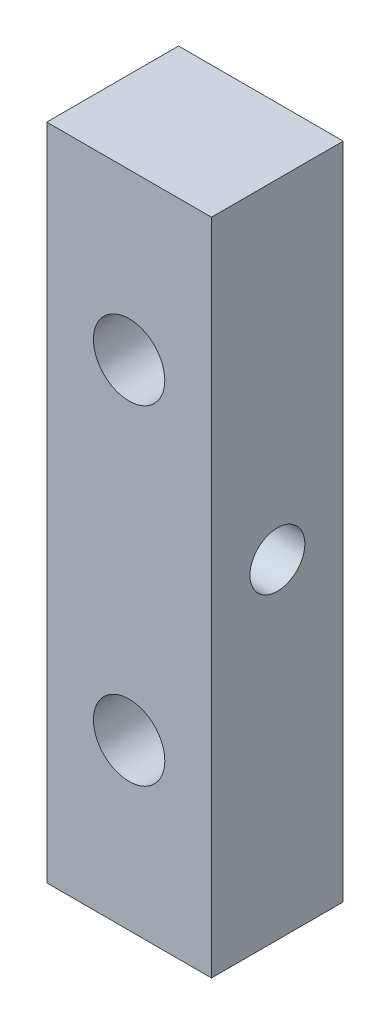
ISO-10303-21;
HEADER;
FILE_DESCRIPTION(('STEP AP214'),'2;1');
FILE_NAME('part.step','',(''),(''),'','','');
FILE_SCHEMA(('AUTOMOTIVE_DESIGN { 1 0 10303 214 1 1 1 1 }'));
ENDSEC;
DATA;
#1=APPLICATION_CONTEXT('core data for automotive mechanical design processes');
#2=APPLICATION_PROTOCOL_DEFINITION('international standard','automotive_design',2000,#1);
#3=PRODUCT_CONTEXT('',#1,'mechanical');
#4=PRODUCT('Part','Part','',(#3));
#5=PRODUCT_RELATED_PRODUCT_CATEGORY('part','',(#4));
#6=PRODUCT_DEFINITION_FORMATION('','',#4);
#7=PRODUCT_DEFINITION_CONTEXT('part definition',#1,'design');
#8=PRODUCT_DEFINITION('design','',#6,#7);
#9=PRODUCT_DEFINITION_SHAPE('','',#8);
#10=(LENGTH_UNIT() NAMED_UNIT(*) SI_UNIT(.MILLI.,.METRE.));
#11=(NAMED_UNIT(*) PLANE_ANGLE_UNIT() SI_UNIT($,.RADIAN.));
#12=(NAMED_UNIT(*) SI_UNIT($,.STERADIAN.) SOLID_ANGLE_UNIT());
#13=UNCERTAINTY_MEASURE_WITH_UNIT(LENGTH_MEASURE(1.E-05),#10,'distance_accuracy_value','');
#14=(GEOMETRIC_REPRESENTATION_CONTEXT(3) GLOBAL_UNCERTAINTY_ASSIGNED_CONTEXT((#13)) GLOBAL_UNIT_ASSIGNED_CONTEXT((#10,
#11,#12)) REPRESENTATION_CONTEXT('',''));
#15=CARTESIAN_POINT('',(0.,0.,0.));
#16=DIRECTION('',(0.,0.,1.));
#17=DIRECTION('',(1.,0.,0.));
#18=AXIS2_PLACEMENT_3D('',#15,#16,#17);
#19=CARTESIAN_POINT('',(-7.5,0.,6.));
#20=DIRECTION('',(-1.,0.,0.));
#21=DIRECTION('',(0.,0.,1.));
#22=AXIS2_PLACEMENT_3D('',#19,#20,#21);
#23=CYLINDRICAL_SURFACE('',#22,2.5);
#24=CARTESIAN_POINT('',(7.5,0.,6.));
#25=DIRECTION('',(-1.,0.,0.));
#26=DIRECTION('',(0.,0.,1.));
#27=AXIS2_PLACEMENT_3D('',#24,#25,#26);
#28=CIRCLE('',#27,2.5);
#29=CARTESIAN_POINT('',(7.5,0.,8.5));
#30=VERTEX_POINT('',#29);
#31=EDGE_CURVE('E70',#30,#30,#28,.F.);
#32=ORIENTED_EDGE('',*,*,#31,.T.);
#33=EDGE_LOOP('',(#32));
#34=FACE_BOUND('',#33,.T.);
#35=CARTESIAN_POINT('',(-7.5,0.,6.));
#36=DIRECTION('',(-1.,0.,0.));
#37=DIRECTION('',(0.,0.,1.));
#38=AXIS2_PLACEMENT_3D('',#35,#36,#37);
#39=CIRCLE('',#38,2.5);
#40=CARTESIAN_POINT('',(-7.5,0.,8.5));
#41=VERTEX_POINT('',#40);
#42=EDGE_CURVE('E76',#41,#41,#39,.T.);
#43=ORIENTED_EDGE('',*,*,#42,.T.);
#44=EDGE_LOOP('',(#43));
#45=FACE_BOUND('',#44,.T.);
#46=ADVANCED_FACE('F17',(#34,#45),#23,.F.);
#47=CARTESIAN_POINT('',(0.,0.,0.));
#48=DIRECTION('',(0.,0.,1.));
#49=DIRECTION('',(1.,0.,0.));
#50=AXIS2_PLACEMENT_3D('',#47,#48,#49);
#51=PLANE('',#50);
#52=DIRECTION('',(1.,0.,0.));
#53=VECTOR('',#52,1.);
#54=CARTESIAN_POINT('',(-7.5,-30.,0.));
#55=LINE('',#54,#53);
#56=CARTESIAN_POINT('',(7.5,-30.,0.));
#57=VERTEX_POINT('',#56);
#58=CARTESIAN_POINT('',(-7.5,-30.,0.));
#59=VERTEX_POINT('',#58);
#60=EDGE_CURVE('E92',#57,#59,#55,.F.);
#61=ORIENTED_EDGE('',*,*,#60,.T.);
#62=DIRECTION('',(0.,1.,0.));
#63=VECTOR('',#62,1.);
#64=CARTESIAN_POINT('',(-7.5,30.,0.));
#65=LINE('',#64,#63);
#66=CARTESIAN_POINT('',(-7.5,30.,0.));
#67=VERTEX_POINT('',#66);
#68=EDGE_CURVE('E74',#59,#67,#65,.T.);
#69=ORIENTED_EDGE('',*,*,#68,.T.);
#70=DIRECTION('',(1.,0.,0.));
#71=VECTOR('',#70,1.);
#72=CARTESIAN_POINT('',(-7.5,30.,0.));
#73=LINE('',#72,#71);
#74=CARTESIAN_POINT('',(7.5,30.,0.));
#75=VERTEX_POINT('',#74);
#76=EDGE_CURVE('E55',#67,#75,#73,.T.);
#77=ORIENTED_EDGE('',*,*,#76,.T.);
#78=DIRECTION('',(0.,-1.,0.));
#79=VECTOR('',#78,1.);
#80=CARTESIAN_POINT('',(7.5,30.,0.));
#81=LINE('',#80,#79);
#82=EDGE_CURVE('E60',#75,#57,#81,.T.);
#83=ORIENTED_EDGE('',*,*,#82,.T.);
#84=EDGE_LOOP('',(#61,#69,#77,#83));
#85=FACE_BOUND('',#84,.T.);
#86=CARTESIAN_POINT('',(0.,15.,0.));
#87=DIRECTION('',(0.,0.,1.));
#88=DIRECTION('',(1.,0.,0.));
#89=AXIS2_PLACEMENT_3D('',#86,#87,#88);
#90=CIRCLE('',#89,3.25);
#91=CARTESIAN_POINT('',(3.25,15.,0.));
#92=VERTEX_POINT('',#91);
#93=EDGE_CURVE('E97',#92,#92,#90,.T.);
#94=ORIENTED_EDGE('',*,*,#93,.T.);
#95=EDGE_LOOP('',(#94));
#96=FACE_BOUND('',#95,.T.);
#97=CARTESIAN_POINT('',(0.,-15.,0.));
#98=DIRECTION('',(0.,0.,1.));
#99=DIRECTION('',(1.,0.,0.));
#100=AXIS2_PLACEMENT_3D('',#97,#98,#99);
#101=CIRCLE('',#100,3.25);
#102=CARTESIAN_POINT('',(3.25,-15.,0.));
#103=VERTEX_POINT('',#102);
#104=EDGE_CURVE('E20',#103,#103,#101,.T.);
#105=ORIENTED_EDGE('',*,*,#104,.T.);
#106=EDGE_LOOP('',(#105));
#107=FACE_BOUND('',#106,.T.);
#108=ADVANCED_FACE('F72',(#85,#96,#107),#51,.F.);
#109=CARTESIAN_POINT('',(0.,-15.,0.));
#110=DIRECTION('',(0.,0.,1.));
#111=DIRECTION('',(1.,0.,0.));
#112=AXIS2_PLACEMENT_3D('',#109,#110,#111);
#113=CYLINDRICAL_SURFACE('',#112,3.25);
#114=CARTESIAN_POINT('',(0.,-15.,12.));
#115=DIRECTION('',(0.,0.,1.));
#116=DIRECTION('',(1.,0.,0.));
#117=AXIS2_PLACEMENT_3D('',#114,#115,#116);
#118=CIRCLE('',#117,3.25);
#119=CARTESIAN_POINT('',(3.25,-15.,12.));
#120=VERTEX_POINT('',#119);
#121=EDGE_CURVE('E89',#120,#120,#118,.F.);
#122=ORIENTED_EDGE('',*,*,#121,.F.);
#123=EDGE_LOOP('',(#122));
#124=FACE_BOUND('',#123,.T.);
#125=ORIENTED_EDGE('',*,*,#104,.F.);
#126=EDGE_LOOP('',(#125));
#127=FACE_BOUND('',#126,.T.);
#128=ADVANCED_FACE('F104',(#124,#127),#113,.F.);
#129=CARTESIAN_POINT('',(0.,15.,0.));
#130=DIRECTION('',(0.,0.,1.));
#131=DIRECTION('',(1.,0.,0.));
#132=AXIS2_PLACEMENT_3D('',#129,#130,#131);
#133=CYLINDRICAL_SURFACE('',#132,3.25);
#134=CARTESIAN_POINT('',(0.,15.,12.));
#135=DIRECTION('',(0.,0.,1.));
#136=DIRECTION('',(1.,0.,0.));
#137=AXIS2_PLACEMENT_3D('',#134,#135,#136);
#138=CIRCLE('',#137,3.25);
#139=CARTESIAN_POINT('',(3.25,15.,12.));
#140=VERTEX_POINT('',#139);
#141=EDGE_CURVE('E85',#140,#140,#138,.F.);
#142=ORIENTED_EDGE('',*,*,#141,.F.);
#143=EDGE_LOOP('',(#142));
#144=FACE_BOUND('',#143,.T.);
#145=ORIENTED_EDGE('',*,*,#93,.F.);
#146=EDGE_LOOP('',(#145));
#147=FACE_BOUND('',#146,.T.);
#148=ADVANCED_FACE('F106',(#144,#147),#133,.F.);
#149=CARTESIAN_POINT('',(7.5,30.,12.));
#150=DIRECTION('',(-1.,0.,0.));
#151=DIRECTION('',(0.,-1.,0.));
#152=AXIS2_PLACEMENT_3D('',#149,#150,#151);
#153=PLANE('',#152);
#154=DIRECTION('',(0.,0.,-1.));
#155=VECTOR('',#154,1.);
#156=CARTESIAN_POINT('',(7.5,30.,12.));
#157=LINE('',#156,#155);
#158=CARTESIAN_POINT('',(7.5,30.,12.));
#159=VERTEX_POINT('',#158);
#160=EDGE_CURVE('E63',#75,#159,#157,.F.);
#161=ORIENTED_EDGE('',*,*,#160,.T.);
#162=DIRECTION('',(0.,1.,0.));
#163=VECTOR('',#162,1.);
#164=CARTESIAN_POINT('',(7.5,0.,12.));
#165=LINE('',#164,#163);
#166=CARTESIAN_POINT('',(7.5,-30.,12.));
#167=VERTEX_POINT('',#166);
#168=EDGE_CURVE('E88',#167,#159,#165,.T.);
#169=ORIENTED_EDGE('',*,*,#168,.F.);
#170=DIRECTION('',(0.,0.,1.));
#171=VECTOR('',#170,1.);
#172=CARTESIAN_POINT('',(7.5,-30.,12.));
#173=LINE('',#172,#171);
#174=EDGE_CURVE('E66',#167,#57,#173,.F.);
#175=ORIENTED_EDGE('',*,*,#174,.T.);
#176=ORIENTED_EDGE('',*,*,#82,.F.);
#177=EDGE_LOOP('',(#161,#169,#175,#176));
#178=FACE_BOUND('',#177,.T.);
#179=ORIENTED_EDGE('',*,*,#31,.F.);
#180=EDGE_LOOP('',(#179));
#181=FACE_BOUND('',#180,.T.);
#182=ADVANCED_FACE('F61',(#178,#181),#153,.F.);
#183=CARTESIAN_POINT('',(-7.5,30.,12.));
#184=DIRECTION('',(0.,-1.,0.));
#185=DIRECTION('',(0.,0.,-1.));
#186=AXIS2_PLACEMENT_3D('',#183,#184,#185);
#187=PLANE('',#186);
#188=DIRECTION('',(0.,0.,1.));
#189=VECTOR('',#188,1.);
#190=CARTESIAN_POINT('',(-7.5,30.,12.));
#191=LINE('',#190,#189);
#192=CARTESIAN_POINT('',(-7.5,30.,12.));
#193=VERTEX_POINT('',#192);
#194=EDGE_CURVE('E95',#67,#193,#191,.T.);
#195=ORIENTED_EDGE('',*,*,#194,.T.);
#196=DIRECTION('',(1.,0.,0.));
#197=VECTOR('',#196,1.);
#198=CARTESIAN_POINT('',(0.,30.,12.));
#199=LINE('',#198,#197);
#200=EDGE_CURVE('E80',#159,#193,#199,.F.);
#201=ORIENTED_EDGE('',*,*,#200,.F.);
#202=ORIENTED_EDGE('',*,*,#160,.F.);
#203=ORIENTED_EDGE('',*,*,#76,.F.);
#204=EDGE_LOOP('',(#195,#201,#202,#203));
#205=FACE_BOUND('',#204,.T.);
#206=ADVANCED_FACE('F78',(#205),#187,.F.);
#207=CARTESIAN_POINT('',(-7.5,30.,12.));
#208=DIRECTION('',(1.,0.,0.));
#209=DIRECTION('',(0.,1.,0.));
#210=AXIS2_PLACEMENT_3D('',#207,#208,#209);
#211=PLANE('',#210);
#212=DIRECTION('',(0.,0.,1.));
#213=VECTOR('',#212,1.);
#214=CARTESIAN_POINT('',(-7.5,-30.,12.));
#215=LINE('',#214,#213);
#216=CARTESIAN_POINT('',(-7.5,-30.,12.));
#217=VERTEX_POINT('',#216);
#218=EDGE_CURVE('E35',#59,#217,#215,.T.);
#219=ORIENTED_EDGE('',*,*,#218,.T.);
#220=DIRECTION('',(0.,1.,0.));
#221=VECTOR('',#220,1.);
#222=CARTESIAN_POINT('',(-7.5,0.,12.));
#223=LINE('',#222,#221);
#224=EDGE_CURVE('E26',#193,#217,#223,.F.);
#225=ORIENTED_EDGE('',*,*,#224,.F.);
#226=ORIENTED_EDGE('',*,*,#194,.F.);
#227=ORIENTED_EDGE('',*,*,#68,.F.);
#228=EDGE_LOOP('',(#219,#225,#226,#227));
#229=FACE_BOUND('',#228,.T.);
#230=ORIENTED_EDGE('',*,*,#42,.F.);
#231=EDGE_LOOP('',(#230));
#232=FACE_BOUND('',#231,.T.);
#233=ADVANCED_FACE('F125',(#229,#232),#211,.F.);
#234=CARTESIAN_POINT('',(-7.5,-30.,12.));
#235=DIRECTION('',(0.,1.,0.));
#236=DIRECTION('',(0.,0.,1.));
#237=AXIS2_PLACEMENT_3D('',#234,#235,#236);
#238=PLANE('',#237);
#239=ORIENTED_EDGE('',*,*,#174,.F.);
#240=DIRECTION('',(1.,0.,0.));
#241=VECTOR('',#240,1.);
#242=CARTESIAN_POINT('',(0.,-30.,12.));
#243=LINE('',#242,#241);
#244=EDGE_CURVE('E11',#217,#167,#243,.T.);
#245=ORIENTED_EDGE('',*,*,#244,.F.);
#246=ORIENTED_EDGE('',*,*,#218,.F.);
#247=ORIENTED_EDGE('',*,*,#60,.F.);
#248=EDGE_LOOP('',(#239,#245,#246,#247));
#249=FACE_BOUND('',#248,.T.);
#250=ADVANCED_FACE('F119',(#249),#238,.F.);
#251=CARTESIAN_POINT('',(0.,0.,12.));
#252=DIRECTION('',(0.,0.,1.));
#253=DIRECTION('',(1.,0.,0.));
#254=AXIS2_PLACEMENT_3D('',#251,#252,#253);
#255=PLANE('',#254);
#256=ORIENTED_EDGE('',*,*,#224,.T.);
#257=ORIENTED_EDGE('',*,*,#244,.T.);
#258=ORIENTED_EDGE('',*,*,#168,.T.);
#259=ORIENTED_EDGE('',*,*,#200,.T.);
#260=EDGE_LOOP('',(#256,#257,#258,#259));
#261=FACE_BOUND('',#260,.T.);
#262=ORIENTED_EDGE('',*,*,#141,.T.);
#263=EDGE_LOOP('',(#262));
#264=FACE_BOUND('',#263,.T.);
#265=ORIENTED_EDGE('',*,*,#121,.T.);
#266=EDGE_LOOP('',(#265));
#267=FACE_BOUND('',#266,.T.);
#268=ADVANCED_FACE('F117',(#261,#264,#267),#255,.T.);
#269=CLOSED_SHELL('',(#46,#108,#128,#148,#182,#206,#233,#250,#268));
#270=MANIFOLD_SOLID_BREP('B1',#269);
#271=ADVANCED_BREP_SHAPE_REPRESENTATION('',(#18,#270),#14);
#272=SHAPE_DEFINITION_REPRESENTATION(#9,#271);
ENDSEC;
END-ISO-10303-21;
